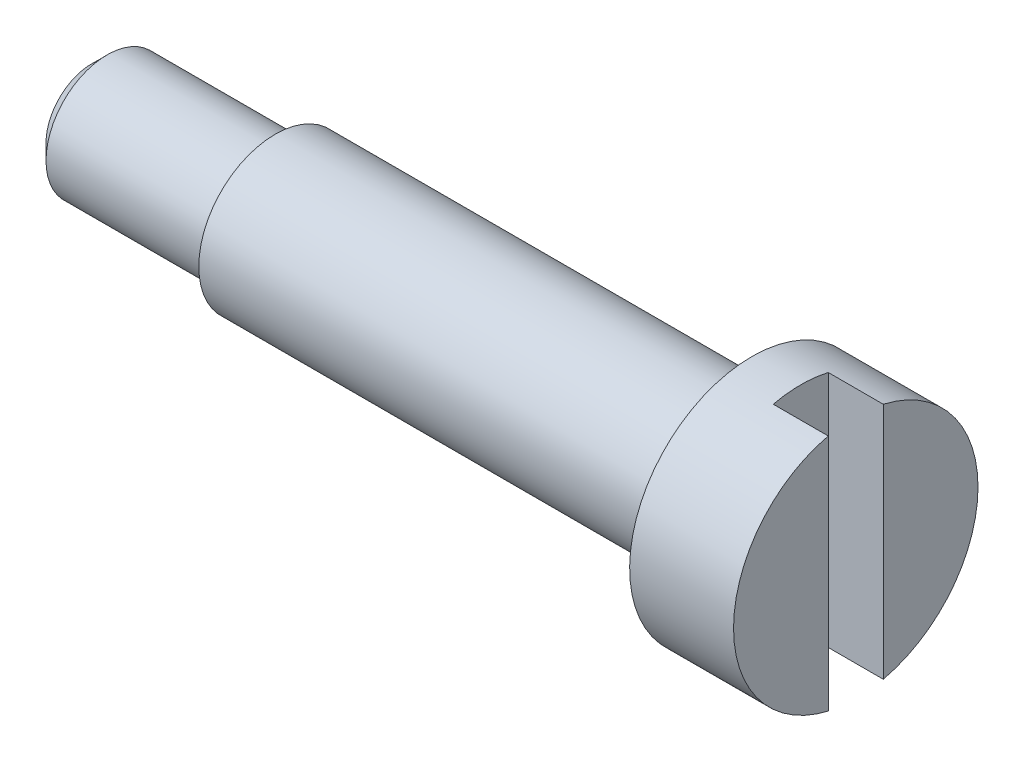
from build123d import *

# Parameters (mm, degrees)
ESQUISSE1_R             = 2
BASE_EXTRUSION_DEPTH    = 1.7
ENL_V_START             = -0.9
ENL_V_MAT_EXTRU_1_DEPTH = 0.9
BOSS_EXTRU_1_DEPTH      = 0.9
ESQUISSE4_R             = 1.25
BOSS_EXTRU_2_DEPTH      = 7.8
ESQUISSE5_R             = 1
BOSS_EXTRU_3_DEPTH      = 3
CHANFREIN1_SIZE         = 0.25


with BuildPart() as part:
    # Esquisse1 → Base-Extrusion (new body)
    with BuildSketch(Plane(origin=(-34.2, 0, 0), x_dir=(0, -1, 0), z_dir=(-1, 0, 0))):
        with Locations(Location((0, 0, 0), (0, 0, 13.002878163))):
            Circle(ESQUISSE1_R)
    extrude(amount=-BASE_EXTRUSION_DEPTH)

    # Esquisse2 → Enl_v. mat.-Extru.1 (cut)
    with BuildSketch(Plane(origin=(-32.5, 0, 0), x_dir=(0, 0, -1), z_dir=(1, 0, 0)).offset(ENL_V_START)):
        with BuildLine():
            Line((0.45, -1.948717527), (0.45, 1.948717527))
            ThreePointArc((0.45, 1.948717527), (-2, 0), (0.45, -1.948717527))
        make_face()
    extrude(amount=ENL_V_MAT_EXTRU_1_DEPTH, mode=Mode.SUBTRACT)

    # Esquisse3 → Boss.-Extru.1 (add)
    with BuildSketch(Plane(origin=(-33.4, 0, 0), x_dir=(0, 0, -1), z_dir=(1, 0, 0))):
        with BuildLine():
            Line((-0.45, 1.948717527), (-0.45, -1.948717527))
            ThreePointArc((-0.45, -1.948717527), (-2, 0), (-0.45, 1.948717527))
        make_face()
    extrude(amount=BOSS_EXTRU_1_DEPTH)

    # Esquisse4 → Boss.-Extru.2 (add)
    with BuildSketch(Plane.ZY.offset(34.2)):
        with Locations(Location((0, 0, 0), (0, 0, 180))):
            Circle(ESQUISSE4_R)
    extrude(amount=BOSS_EXTRU_2_DEPTH)

    # Esquisse5 → Boss.-Extru.3 (add)
    with BuildSketch(Plane.ZY.offset(42)):
        Circle(ESQUISSE5_R)
    extrude(amount=BOSS_EXTRU_3_DEPTH)

    # Chanfrein1
    chanfrein1_edges = [part.edges().sort_by_distance(p)[0] for p in [
        (-45, 0, -1),
    ]]
    chamfer(chanfrein1_edges, length=CHANFREIN1_SIZE)


solid = part.part
